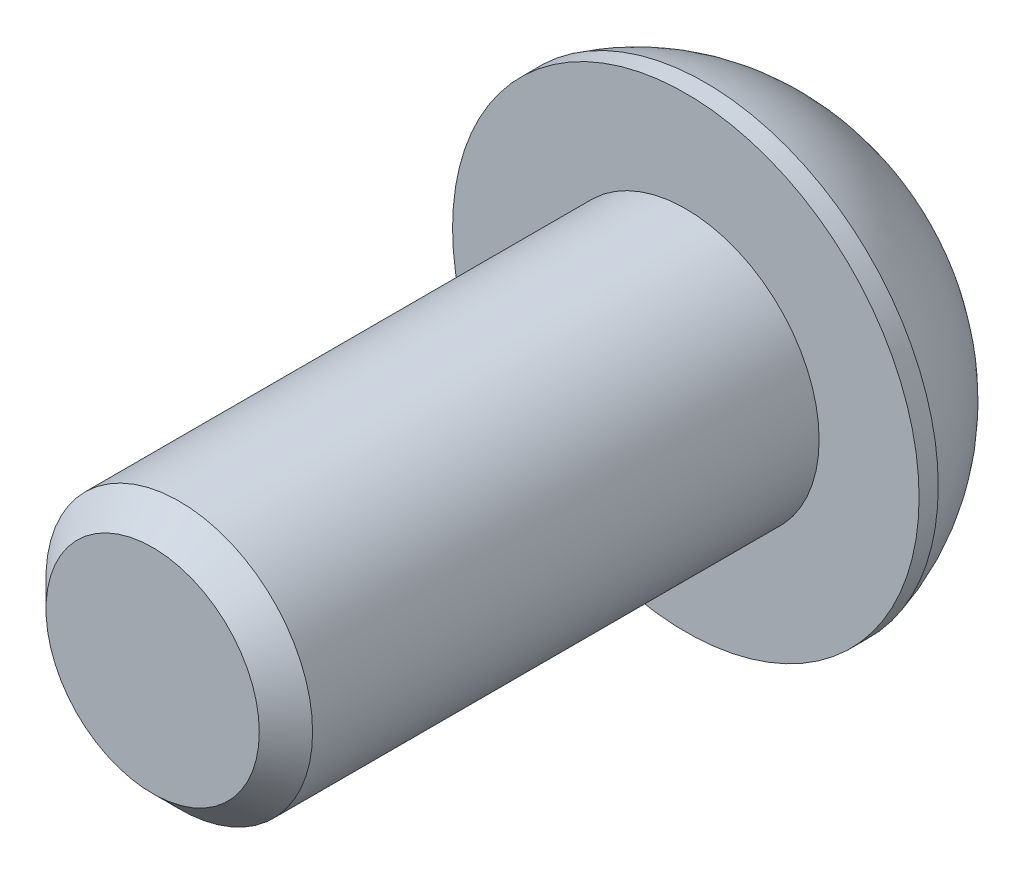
from build123d import *

# Parameters (mm, degrees)
ENLEV_MAT_EXTRU1_DEPTH = 2.6
ESQUISSE3_W            = 4
ESQUISSE3_H            = 16
CHANFREIN1_SIZE        = 0.8


with BuildPart() as part:
    # Esquisse1 → Base-R_volution (revolve)
    with BuildSketch(Plane(origin=(0, 0, 0), x_dir=(1, 0, 0), z_dir=(0, 1, 0)), mode=Mode.PRIVATE) as base_r_volution_sk:
        with BuildLine():
            Line((0, 0), (7, 0))
            Line((7, 0), (7, 0.574933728))
            ThreePointArc((7, 0.574933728), (5.912888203, 2.77937838), (4.064923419, 4.4))
            Line((4.064923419, 4.4), (0, 4.4))
            Line((0, 4.4), (0, 0))
        make_face()
    revolve(base_r_volution_sk.sketch.rotate(Axis((0, 0, 0), (0, 0, -1)), 180), axis=Axis((0, 0, 0), (0, 0, -1)))

    # Esquisse2 → enlev-mat-Extru1 (cut)
    with BuildSketch(Plane.XY.offset(-4.4)):
        Polygon((2.5, -1.443375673), (2.5, 1.443375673), (0, 2.886751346), (-2.5, 1.443375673), (-2.5, -1.443375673), (0, -2.886751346), align=None)
    extrude(amount=ENLEV_MAT_EXTRU1_DEPTH, mode=Mode.SUBTRACT)

    # Esquisse3 → Boss.-R_vol.1 (revolve)
    with BuildSketch(Plane(origin=(0, 0, 0), x_dir=(1, 0, 0), z_dir=(0, 1, 0)), mode=Mode.PRIVATE) as boss_r_vol_1_sk:
        with Locations((2, -8)):
            Rectangle(ESQUISSE3_W, ESQUISSE3_H)
    revolve(boss_r_vol_1_sk.sketch.rotate(Axis((0, 0, 0), (0, 0, 1)), 180), axis=Axis((0, 0, 0), (0, 0, 1)))

    # Chanfrein1
    chanfrein1_edges = [part.edges().sort_by_distance(p)[0] for p in [
        (4, 0, 16),
    ]]
    chamfer(chanfrein1_edges, length=CHANFREIN1_SIZE)


solid = part.part
